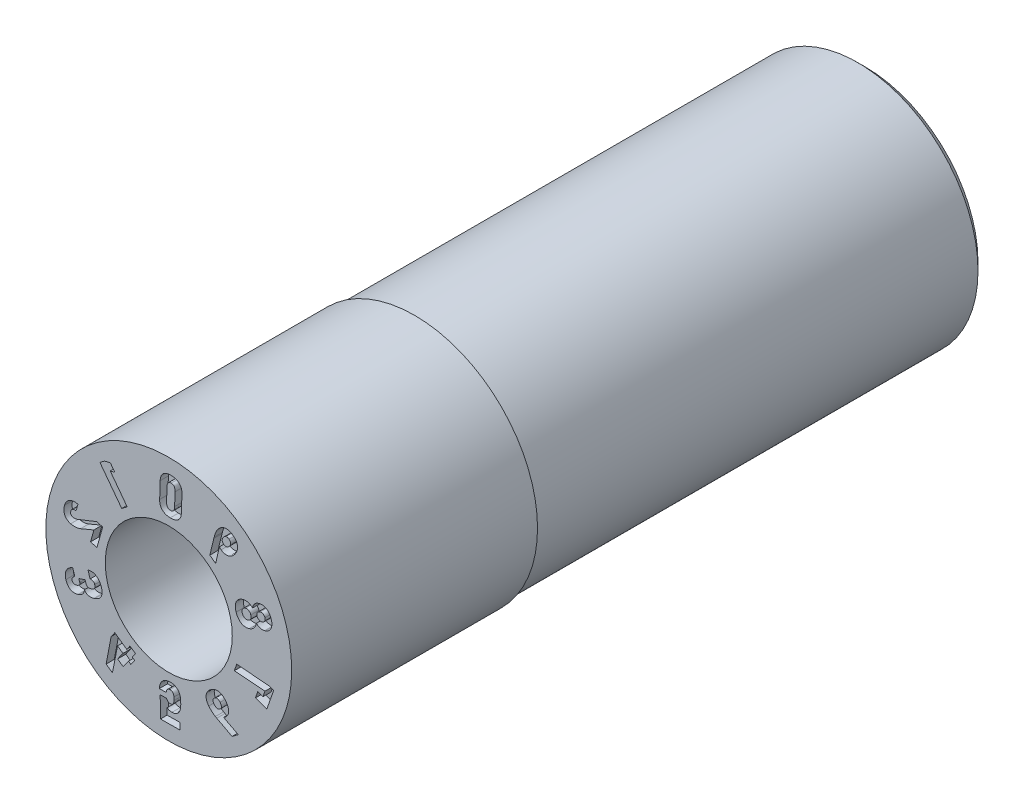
from build123d import *

# Parameters (mm, degrees)
SKETCH4_W          = 11
SKETCH4_H          = 1
CUT_EXTRUDE1_DEPTH = 0.2
CUT_EXTRUDE2_DEPTH = 1.4


with BuildPart() as part:
    # Sketch1 → Revolve1 (revolve)
    with BuildSketch(Plane(origin=(0, 0, 0), x_dir=(0, 0, -1), z_dir=(1, 0, 0)), mode=Mode.PRIVATE) as revolve1_sk:
        Polygon((0, 3), (0, 1.55), (2.8, 1.55), (2.8, 0.8), (14, 0.8), (14, 1.5), (17, 1.5), (17, 2.75), (16.75, 3), align=None)
    revolve(revolve1_sk.sketch.rotate(Axis((0, 0, 3.797909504), (0, 0, -1)), 90), axis=Axis((0, 0, 3.797909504), (0, 0, -1)))

    # Sketch4 → Cut-Revolve1 (revolve, cut)
    with BuildSketch(Plane(origin=(0, 0, 0), x_dir=(0, 0, -1), z_dir=(1, 0, 0)), mode=Mode.PRIVATE) as cut_revolve1_sk:
        with Locations((11.5, 3.435)):
            Rectangle(SKETCH4_W, SKETCH4_H)
    revolve(cut_revolve1_sk.sketch.rotate(Axis((0, 0, 0), (0, 0, -1)), 90), axis=Axis((0, 0, 0), (0, 0, -1)), mode=Mode.SUBTRACT)

    # Sketch2 → Cut-Extrude1 (cut)
    # profile 1 of 10: a face of its own
    with BuildSketch(Plane.XY):
        with BuildLine():
            Line((1.964602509, 0.360281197), (1.978305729, 0.364923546))
            add(Edge.make_bspline(
                [(1.978305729, 0.364923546), (1.999021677, 0.371653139), (2.028594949, 0.386307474), (2.062842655, 0.413973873), (2.085719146, 0.438402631), (2.1052431, 0.465706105), (2.126346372, 0.504769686), (2.134925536, 0.537074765), (2.137948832, 0.55886042)],
                knots=[0, 0, 0, 0, 0.246977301, 0.370172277, 0.497924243, 0.625566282, 0.750117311, 1, 1, 1, 1], degree=3))
            add(Edge.make_bspline(
                [(2.137948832, 0.55886042), (2.151127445, 0.545386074), (2.173444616, 0.527960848), (2.206977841, 0.511088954), (2.233397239, 0.501976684), (2.260490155, 0.496399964), (2.296360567, 0.494101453), (2.322846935, 0.498784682), (2.339563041, 0.504291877)],
                knots=[0, 0, 0, 0, 0.257134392, 0.383027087, 0.511099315, 0.63762545, 0.759670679, 1, 1, 1, 1], degree=3))
            Line((2.339563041, 0.504291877), (2.361401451, 0.511654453))
            add(Edge.make_bspline(
                [(2.361401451, 0.511654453), (2.382108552, 0.518761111), (2.411901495, 0.532182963), (2.445782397, 0.558243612), (2.467183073, 0.580585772), (2.485380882, 0.605414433), (2.499315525, 0.632951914), (2.509553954, 0.662567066), (2.515563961, 0.694213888), (2.517836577, 0.72751529), (2.515072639, 0.774795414), (2.506337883, 0.8101513), (2.498644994, 0.833531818)],
                knots=[0, 0, 0, 0, 0.167140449, 0.246141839, 0.32429089, 0.402157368, 0.479801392, 0.558524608, 0.640148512, 0.72448726, 0.81225289, 1, 1, 1, 1], degree=3))
            add(Edge.make_bspline(
                [(2.498644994, 0.833531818), (2.490694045, 0.856893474), (2.476526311, 0.89048181), (2.450317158, 0.930008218), (2.428613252, 0.955335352), (2.404753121, 0.977008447), (2.378812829, 0.994501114), (2.35109959, 1.008034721), (2.321751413, 1.017201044), (2.291155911, 1.022097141), (2.248450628, 1.022395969), (2.216499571, 1.015695), (2.195720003, 1.008769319)],
                knots=[0, 0, 0, 0, 0.188262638, 0.275658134, 0.360331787, 0.44174499, 0.520455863, 0.597882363, 0.675873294, 0.753814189, 0.833077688, 1, 1, 1, 1], degree=3))
            Line((2.195720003, 1.008769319), (2.173881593, 1.001406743))
            add(Edge.make_bspline(
                [(2.173881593, 1.001406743), (2.156757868, 0.996044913), (2.132876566, 0.983189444), (2.104937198, 0.96001663), (2.086865, 0.938895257), (2.071212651, 0.915643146), (2.055116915, 0.881527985), (2.048020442, 0.853998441), (2.045931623, 0.835131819)],
                knots=[0, 0, 0, 0, 0.242123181, 0.364086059, 0.49024928, 0.617698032, 0.743096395, 1, 1, 1, 1], degree=3))
            add(Edge.make_bspline(
                [(2.045931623, 0.835131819), (2.030312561, 0.851069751), (2.003665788, 0.871822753), (1.963168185, 0.891047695), (1.931146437, 0.901348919), (1.898246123, 0.907382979), (1.854338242, 0.909158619), (1.821886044, 0.903240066), (1.80123526, 0.89645942)],
                knots=[0, 0, 0, 0, 0.252199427, 0.377454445, 0.505057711, 0.631379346, 0.754394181, 1, 1, 1, 1], degree=3))
            Line((1.80123526, 0.89645942), (1.787532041, 0.89181707))
            add(Edge.make_bspline(
                [(1.787532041, 0.89181707), (1.765494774, 0.884372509), (1.734016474, 0.869923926), (1.698002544, 0.842328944), (1.675291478, 0.818623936), (1.656242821, 0.792087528), (1.641445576, 0.762904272), (1.630953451, 0.731280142), (1.624345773, 0.697532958), (1.622210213, 0.661894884), (1.625524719, 0.611304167), (1.634495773, 0.573406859), (1.642966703, 0.548376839)],
                knots=[0, 0, 0, 0, 0.166585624, 0.245063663, 0.323249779, 0.400569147, 0.477894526, 0.556350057, 0.63817055, 0.723193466, 0.810970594, 1, 1, 1, 1], degree=3))
            add(Edge.make_bspline(
                [(1.642966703, 0.548376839), (1.651377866, 0.523313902), (1.666885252, 0.48760909), (1.694469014, 0.445100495), (1.717650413, 0.41801522), (1.74287253, 0.394579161), (1.77054307, 0.375849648), (1.799857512, 0.361260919), (1.830964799, 0.351454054), (1.863371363, 0.346199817), (1.908698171, 0.345591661), (1.942555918, 0.353086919), (1.964602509, 0.360281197)],
                knots=[0, 0, 0, 0, 0.189148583, 0.276863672, 0.361539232, 0.44357587, 0.522394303, 0.59972543, 0.677021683, 0.754789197, 0.833794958, 1, 1, 1, 1], degree=3))
        make_face()
        with BuildLine():
            Line((1.863082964, 0.741611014), (1.871218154, 0.74433124))
            add(Edge.make_bspline(
                [(1.871218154, 0.74433124), (1.880125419, 0.747311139), (1.893869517, 0.750183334), (1.912189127, 0.749679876), (1.925314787, 0.747443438), (1.937900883, 0.74331078), (1.949854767, 0.737448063), (1.961007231, 0.729832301), (1.971385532, 0.720602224), (1.980628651, 0.709606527), (1.992225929, 0.692718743), (1.998212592, 0.678066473), (2.001674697, 0.667959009)],
                knots=[0, 0, 0, 0, 0.166218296, 0.245090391, 0.322722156, 0.400755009, 0.478423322, 0.557266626, 0.638757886, 0.723096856, 0.810567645, 1, 1, 1, 1], degree=3))
            add(Edge.make_bspline(
                [(2.001674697, 0.667959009), (2.004932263, 0.657796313), (2.008911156, 0.642518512), (2.009894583, 0.622044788), (2.008872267, 0.607671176), (2.006390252, 0.593899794), (2.001936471, 0.581009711), (1.995832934, 0.569074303), (1.988026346, 0.558245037), (1.978797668, 0.548543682), (1.964196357, 0.537306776), (1.951459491, 0.53138556), (1.942490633, 0.528476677)],
                knots=[0, 0, 0, 0, 0.188381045, 0.275513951, 0.359781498, 0.441669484, 0.52114919, 0.598996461, 0.676872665, 0.755389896, 0.833935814, 1, 1, 1, 1], degree=3))
            Line((1.942490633, 0.528476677), (1.933813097, 0.525575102))
            add(Edge.make_bspline(
                [(1.933813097, 0.525575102), (1.924123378, 0.522347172), (1.909345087, 0.519161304), (1.889500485, 0.518810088), (1.875350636, 0.520901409), (1.861813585, 0.524720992), (1.849058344, 0.530364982), (1.837099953, 0.537701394), (1.826335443, 0.547112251), (1.81652342, 0.557906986), (1.805273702, 0.574934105), (1.798471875, 0.588952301), (1.795330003, 0.599082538)],
                knots=[0, 0, 0, 0, 0.173701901, 0.255120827, 0.336326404, 0.416101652, 0.493685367, 0.572898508, 0.653753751, 0.736097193, 0.82027794, 1, 1, 1, 1], degree=3))
            add(Edge.make_bspline(
                [(1.795330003, 0.599082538), (1.791985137, 0.60908734), (1.788427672, 0.624412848), (1.787894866, 0.644899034), (1.789073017, 0.659569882), (1.79239661, 0.673572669), (1.797434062, 0.686763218), (1.804522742, 0.698925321), (1.813146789, 0.710186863), (1.823560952, 0.720266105), (1.839688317, 0.731942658), (1.853318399, 0.738624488), (1.863082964, 0.741611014)],
                knots=[0, 0, 0, 0, 0.178658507, 0.263512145, 0.345804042, 0.426861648, 0.50607112, 0.583710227, 0.664091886, 0.745271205, 0.827853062, 1, 1, 1, 1], degree=3))
        make_face(mode=Mode.SUBTRACT)
        with BuildLine():
            Line((2.220254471, 0.841263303), (2.228245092, 0.84387489))
            add(Edge.make_bspline(
                [(2.228245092, 0.84387489), (2.236659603, 0.846585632), (2.249409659, 0.849571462), (2.266425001, 0.849817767), (2.278451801, 0.848444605), (2.289899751, 0.845209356), (2.300708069, 0.84055882), (2.310814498, 0.83447973), (2.319974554, 0.826697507), (2.328328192, 0.817709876), (2.338379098, 0.803547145), (2.343463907, 0.791239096), (2.346534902, 0.782790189)],
                knots=[0, 0, 0, 0, 0.177306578, 0.259345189, 0.339545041, 0.4186855, 0.496490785, 0.574445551, 0.653742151, 0.736205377, 0.819476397, 1, 1, 1, 1], degree=3))
            add(Edge.make_bspline(
                [(2.346534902, 0.782790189), (2.349215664, 0.774218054), (2.352617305, 0.761228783), (2.352832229, 0.743826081), (2.351712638, 0.731535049), (2.348841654, 0.7198688), (2.344617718, 0.708809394), (2.338579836, 0.698611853), (2.330965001, 0.689342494), (2.322144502, 0.680868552), (2.308329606, 0.670745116), (2.296227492, 0.66562681), (2.287911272, 0.662730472)],
                knots=[0, 0, 0, 0, 0.179778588, 0.264113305, 0.345718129, 0.425073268, 0.502737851, 0.580810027, 0.660046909, 0.741092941, 0.823978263, 1, 1, 1, 1], degree=3))
            Line((2.287911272, 0.662730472), (2.279233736, 0.659828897))
            add(Edge.make_bspline(
                [(2.279233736, 0.659828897), (2.270461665, 0.656972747), (2.257045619, 0.653856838), (2.239133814, 0.653278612), (2.22634569, 0.654347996), (2.214294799, 0.657268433), (2.202842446, 0.66160841), (2.192275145, 0.667647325), (2.182522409, 0.675161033), (2.173737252, 0.684086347), (2.163456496, 0.698239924), (2.158072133, 0.71053056), (2.155122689, 0.719027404)],
                knots=[0, 0, 0, 0, 0.179105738, 0.264698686, 0.346614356, 0.427117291, 0.504294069, 0.583324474, 0.662147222, 0.742310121, 0.825294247, 1, 1, 1, 1], degree=3))
            add(Edge.make_bspline(
                [(2.155122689, 0.719027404), (2.152231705, 0.727541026), (2.14932644, 0.740621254), (2.149147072, 0.758073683), (2.15073535, 0.770511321), (2.154166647, 0.782300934), (2.158922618, 0.79355591), (2.165605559, 0.803931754), (2.173652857, 0.813716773), (2.183446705, 0.822295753), (2.198491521, 0.832637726), (2.211213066, 0.838437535), (2.220254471, 0.841263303)],
                knots=[0, 0, 0, 0, 0.173002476, 0.255063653, 0.33456394, 0.413146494, 0.490488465, 0.568625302, 0.649590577, 0.733328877, 0.818008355, 1, 1, 1, 1], degree=3))
        make_face(mode=Mode.SUBTRACT)
    # profile 2 of 10: a face of its own
    with BuildSketch(Plane.XY):
        Polygon((-1.025586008, -1.57403933), (-1.317138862, -1.366897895), (-1.406106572, -1.491966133), (-1.528836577, -2.135889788), (-1.374804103, -2.24517577), (-1.250372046, -1.611578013), (-1.118749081, -1.705127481), (-1.248608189, -1.887849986), (-1.11261327, -1.984486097), (-0.982763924, -1.801777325), (-0.926053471, -1.84208361), (-0.832889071, -1.710945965), (-0.889584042, -1.670665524), (-0.810498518, -1.559385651), (-0.946493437, -1.462749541), align=None)
    # profile 3 of 10: a face of its own
    with BuildSketch(Plane.XY):
        with BuildLine():
            Line((1.099289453, 1.833157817), (1.001811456, 1.431176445))
            Line((1.001811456, 1.431176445), (1.145009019, 1.326148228))
            Line((1.145009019, 1.326148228), (1.234386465, 1.724100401))
            add(Edge.make_bspline(
                [(1.234386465, 1.724100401), (1.234844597, 1.723490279), (1.238974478, 1.718068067), (1.2520167, 1.70281286), (1.266960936, 1.690445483), (1.277522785, 1.682527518)],
                knots=[0.56480822, 0.56480822, 0.56480822, 0.56480822, 0.581366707, 0.712723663, 1, 1, 1, 1], degree=3))
            add(Edge.make_bspline(
                [(1.277522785, 1.682527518), (1.294724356, 1.669943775), (1.32237193, 1.65432062), (1.362120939, 1.642053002), (1.392063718, 1.637779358), (1.422242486, 1.637908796), (1.452224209, 1.642661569), (1.481878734, 1.65159691), (1.510908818, 1.664977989), (1.539012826, 1.682614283), (1.575625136, 1.712184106), (1.599545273, 1.739289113), (1.614042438, 1.759031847)],
                knots=[0, 0, 0, 0, 0.16489712, 0.24313443, 0.320511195, 0.397949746, 0.47569089, 0.554488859, 0.636784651, 0.722171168, 0.81048378, 1, 1, 1, 1], degree=3))
            add(Edge.make_bspline(
                [(1.614042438, 1.759031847), (1.630141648, 1.781256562), (1.650985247, 1.814597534), (1.669358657, 1.861979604), (1.677753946, 1.89608169), (1.681315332, 1.92966678), (1.679395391, 1.962443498), (1.672754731, 1.99428175), (1.660819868, 2.025042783), (1.644268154, 2.05475206), (1.614555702, 2.093561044), (1.586161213, 2.118426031), (1.565536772, 2.133684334)],
                knots=[0, 0, 0, 0, 0.187702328, 0.272978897, 0.354472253, 0.432702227, 0.50827368, 0.583207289, 0.659269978, 0.738161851, 0.820329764, 1, 1, 1, 1], degree=3))
            add(Edge.make_bspline(
                [(1.565536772, 2.133684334), (1.544879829, 2.148623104), (1.512752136, 2.16832126), (1.466758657, 2.184458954), (1.433356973, 2.191505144), (1.400194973, 2.193359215), (1.367560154, 2.19004229), (1.335620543, 2.181432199), (1.304388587, 2.167986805), (1.274210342, 2.149470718), (1.23443835, 2.117211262), (1.208204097, 2.087563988), (1.192374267, 2.065581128)],
                knots=[0, 0, 0, 0, 0.177887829, 0.259816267, 0.338331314, 0.414816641, 0.490131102, 0.565735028, 0.644250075, 0.726092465, 0.811433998, 1, 1, 1, 1], degree=3))
            add(Edge.make_bspline(
                [(1.192374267, 2.065581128), (1.182799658, 2.052781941), (1.17024224, 2.032416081), (1.155415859, 2.003408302), (1.145013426, 1.979422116), (1.13520688, 1.953896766), (1.122043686, 1.916929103), (1.114022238, 1.887895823), (1.108395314, 1.868125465)],
                knots=[0, 0, 0, 0, 0.216886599, 0.332678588, 0.453535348, 0.580868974, 0.713539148, 1, 1, 1, 1], degree=3))
            add(Edge.make_bspline(
                [(1.108395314, 1.868125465), (1.106502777, 1.862317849), (1.103501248, 1.850648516), (1.100297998, 1.839028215), (1.099289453, 1.833157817)],
                knots=[0, 0, 0, 0, 0.506531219, 1, 1, 1, 1], degree=3))
        make_face()
        with BuildLine():
            add(Edge.make_bspline(
                [(1.342198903, 1.829578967), (1.331455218, 1.83736316), (1.317246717, 1.851389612), (1.306510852, 1.874768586), (1.303044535, 1.893097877), (1.303996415, 1.912379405), (1.311103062, 1.940324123), (1.32295224, 1.959729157), (1.331954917, 1.972305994)],
                knots=[0, 0, 0, 0, 0.246294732, 0.358615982, 0.470671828, 0.587630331, 0.712559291, 1, 1, 1, 1], degree=3))
            add(Edge.make_bspline(
                [(1.331954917, 1.972305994), (1.341156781, 1.984993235), (1.356108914, 2.000785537), (1.379690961, 2.015571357), (1.397523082, 2.021371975), (1.41569213, 2.023212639), (1.440946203, 2.019530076), (1.458548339, 2.010494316), (1.469136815, 2.002413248)],
                knots=[0, 0, 0, 0, 0.283785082, 0.405907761, 0.522128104, 0.634954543, 0.748096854, 1, 1, 1, 1], degree=3))
            add(Edge.make_bspline(
                [(1.469136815, 2.002413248), (1.479937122, 1.99454623), (1.494367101, 1.980599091), (1.505375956, 1.957287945), (1.508946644, 1.93919959), (1.508279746, 1.920383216), (1.501695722, 1.89328344), (1.490153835, 1.874605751), (1.481561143, 1.862438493)],
                knots=[0, 0, 0, 0, 0.252475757, 0.3668725, 0.47960218, 0.595680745, 0.718088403, 1, 1, 1, 1], degree=3))
            add(Edge.make_bspline(
                [(1.481561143, 1.862438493), (1.471899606, 1.849511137), (1.457104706, 1.83229025), (1.432561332, 1.817487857), (1.414638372, 1.810723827), (1.396151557, 1.808782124), (1.370619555, 1.812190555), (1.35286976, 1.821529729), (1.342198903, 1.829578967)],
                knots=[0, 0, 0, 0, 0.286977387, 0.411209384, 0.527402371, 0.638802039, 0.751662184, 1, 1, 1, 1], degree=3))
        make_face(mode=Mode.SUBTRACT)
    # profile 4 of 10: a face of its own
    with BuildSketch(Plane.XY):
        with BuildLine():
            Line((0.308539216, 1.980095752), (0.321460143, 2.383350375))
            add(Edge.make_bspline(
                [(0.321460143, 2.383350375), (0.321889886, 2.402195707), (0.321389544, 2.429982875), (0.314999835, 2.465523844), (0.308374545, 2.489968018), (0.299743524, 2.512894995), (0.288684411, 2.534128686), (0.275497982, 2.553775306), (0.259962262, 2.571624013), (0.242429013, 2.587789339), (0.222822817, 2.601990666), (0.201201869, 2.614051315), (0.177747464, 2.624283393), (0.152212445, 2.632303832), (0.114407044, 2.640350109), (0.084726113, 2.64318437), (0.064375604, 2.643907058)],
                knots=[0, 0, 0, 0, 0.135818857, 0.198843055, 0.25932173, 0.31779611, 0.374699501, 0.431160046, 0.487607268, 0.544517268, 0.602364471, 0.661319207, 0.722276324, 0.786130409, 0.853499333, 1, 1, 1, 1], degree=3))
            add(Edge.make_bspline(
                [(0.064375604, 2.643907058), (0.043971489, 2.644392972), (0.014043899, 2.643982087), (-0.024170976, 2.637815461), (-0.050296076, 2.631856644), (-0.074368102, 2.623041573), (-0.096777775, 2.612534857), (-0.117241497, 2.599764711), (-0.135667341, 2.584778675), (-0.152165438, 2.567938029), (-0.166738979, 2.549326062), (-0.178920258, 2.528738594), (-0.189334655, 2.506578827), (-0.197375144, 2.482513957), (-0.206087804, 2.44731718), (-0.208379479, 2.419475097), (-0.209216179, 2.400545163)],
                knots=[0, 0, 0, 0, 0.146922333, 0.214044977, 0.277959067, 0.339182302, 0.397900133, 0.455579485, 0.512066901, 0.56819598, 0.624703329, 0.681512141, 0.739766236, 0.800351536, 0.863565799, 1, 1, 1, 1], degree=3))
            Line((-0.209216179, 2.400545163), (-0.222137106, 1.99729054))
            add(Edge.make_bspline(
                [(-0.222137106, 1.99729054), (-0.222565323, 1.978445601), (-0.222069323, 1.950657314), (-0.21567296, 1.915118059), (-0.209079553, 1.890722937), (-0.20040336, 1.867833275), (-0.189154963, 1.846726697), (-0.175937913, 1.8270282), (-0.160526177, 1.809005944), (-0.142934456, 1.792912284), (-0.123479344, 1.77859656), (-0.101830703, 1.766552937), (-0.078289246, 1.756387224), (-0.052766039, 1.74835027), (-0.015030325, 1.740255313), (0.014599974, 1.737472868), (0.034947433, 1.736733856)],
                knots=[0, 0, 0, 0, 0.135852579, 0.198892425, 0.259386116, 0.317476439, 0.374610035, 0.431084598, 0.487863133, 0.544787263, 0.60228845, 0.661257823, 0.722634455, 0.786504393, 0.853462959, 1, 1, 1, 1], degree=3))
            add(Edge.make_bspline(
                [(0.034947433, 1.736733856), (0.055365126, 1.736194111), (0.085254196, 1.736757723), (0.123560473, 1.742698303), (0.149567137, 1.749264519), (0.17375853, 1.757897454), (0.196125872, 1.768668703), (0.216596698, 1.781604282), (0.235087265, 1.79677713), (0.251457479, 1.813884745), (0.26588879, 1.832688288), (0.278345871, 1.853103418), (0.288635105, 1.875293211), (0.296820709, 1.899176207), (0.304966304, 1.934070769), (0.30800387, 1.961405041), (0.308539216, 1.980095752)],
                knots=[0, 0, 0, 0, 0.147137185, 0.214357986, 0.278606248, 0.339919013, 0.398925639, 0.456934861, 0.513791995, 0.570649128, 0.626987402, 0.684089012, 0.742428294, 0.802686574, 0.865482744, 1, 1, 1, 1], degree=3))
        make_face()
        with BuildLine():
            Line((-0.05362895, 2.034658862), (-0.043337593, 2.352414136))
            add(Edge.make_bspline(
                [(-0.043337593, 2.352414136), (-0.042489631, 2.371460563), (-0.0400752, 2.398957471), (-0.028306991, 2.431506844), (-0.018945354, 2.447909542), (-0.009890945, 2.45863898), (-0.002508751, 2.465636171), (0.005948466, 2.471093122), (0.014881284, 2.476089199), (0.024867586, 2.479355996), (0.03959694, 2.482499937), (0.051196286, 2.483339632), (0.059144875, 2.482861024)],
                knots=[0, 0, 0, 0, 0.304248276, 0.43195801, 0.547131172, 0.601686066, 0.654466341, 0.707867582, 0.761045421, 0.8164911, 0.873820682, 1, 1, 1, 1], degree=3))
            add(Edge.make_bspline(
                [(0.059144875, 2.482861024), (0.067116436, 2.482868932), (0.078556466, 2.481190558), (0.09312235, 2.477314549), (0.102694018, 2.472979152), (0.111707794, 2.468108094), (0.119404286, 2.461593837), (0.12654968, 2.454409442), (0.134822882, 2.443015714), (0.143099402, 2.426089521), (0.152523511, 2.392805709), (0.153190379, 2.365264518), (0.152959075, 2.346162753)],
                knots=[0, 0, 0, 0, 0.126047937, 0.183166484, 0.238632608, 0.292582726, 0.345234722, 0.398051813, 0.453219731, 0.568052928, 0.695198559, 1, 1, 1, 1], degree=3))
            Line((0.152959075, 2.346162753), (0.142667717, 2.028407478))
            add(Edge.make_bspline(
                [(0.142667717, 2.028407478), (0.141968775, 2.00930338), (0.139152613, 1.981920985), (0.127906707, 1.949125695), (0.118417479, 1.932756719), (0.109407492, 1.921913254), (0.101837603, 1.915152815), (0.09357109, 1.909368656), (0.084377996, 1.904882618), (0.074512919, 1.901203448), (0.059699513, 1.898205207), (0.048141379, 1.897265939), (0.040178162, 1.897779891)],
                knots=[0, 0, 0, 0, 0.303868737, 0.432040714, 0.547070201, 0.601557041, 0.654951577, 0.707518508, 0.760989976, 0.816720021, 0.873978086, 1, 1, 1, 1], degree=3))
            add(Edge.make_bspline(
                [(0.040178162, 1.897779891), (0.032307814, 1.89831691), (0.020650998, 1.899135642), (0.006304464, 1.903655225), (-0.003461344, 1.907485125), (-0.012109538, 1.912904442), (-0.020206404, 1.918936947), (-0.027088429, 1.926371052), (-0.0354256, 1.937702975), (-0.043482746, 1.954736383), (-0.053410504, 1.987919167), (-0.053730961, 2.015602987), (-0.05362895, 2.034658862)],
                knots=[0, 0, 0, 0, 0.125945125, 0.183291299, 0.238413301, 0.291967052, 0.344823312, 0.398300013, 0.452118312, 0.567781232, 0.695222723, 1, 1, 1, 1], degree=3))
        make_face(mode=Mode.SUBTRACT)
    # profile 5 of 10: a face of its own
    with BuildSketch(Plane.XY):
        Polygon((-1.147767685, 1.343521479), (-1.014558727, 1.443738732), (-1.428816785, 1.994155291), (-1.318332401, 2.026392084), (-1.424847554, 2.167807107), (-1.566207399, 2.13616004), (-1.679995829, 2.050496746), align=None)
    # profile 6 of 10: a face of its own
    with BuildSketch(Plane.XY):
        with BuildLine():
            Line((-1.757329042, 0.759559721), (-2.225232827, 0.574508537))
            add(Edge.make_bspline(
                [(-2.225232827, 0.574508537), (-2.244968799, 0.566656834), (-2.270649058, 0.559351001), (-2.301517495, 0.557578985), (-2.319663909, 0.557302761), (-2.332711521, 0.559893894), (-2.340978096, 0.561864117)],
                knots=[0, 0, 0, 0, 0.540718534, 0.665819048, 0.783786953, 1, 1, 1, 1], degree=3))
            Line((-2.340978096, 0.561864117), (-2.342247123, 0.56221456))
            add(Edge.make_bspline(
                [(-2.342247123, 0.56221456), (-2.352616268, 0.565179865), (-2.367291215, 0.571873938), (-2.382187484, 0.586536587), (-2.389897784, 0.599556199), (-2.39485481, 0.614431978), (-2.397021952, 0.63790424), (-2.393754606, 0.656139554), (-2.390348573, 0.66844971)],
                knots=[0, 0, 0, 0, 0.245532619, 0.356636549, 0.469170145, 0.58559901, 0.709489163, 1, 1, 1, 1], degree=3))
            add(Edge.make_bspline(
                [(-2.390348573, 0.66844971), (-2.38671198, 0.680587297), (-2.379018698, 0.698313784), (-2.361478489, 0.716154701), (-2.346141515, 0.726505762), (-2.328275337, 0.733404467), (-2.300516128, 0.739048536), (-2.278360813, 0.736941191), (-2.263416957, 0.734853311)],
                knots=[0, 0, 0, 0, 0.241005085, 0.354164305, 0.468189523, 0.587647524, 0.713237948, 1, 1, 1, 1], degree=3))
            Line((-2.263416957, 0.734853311), (-2.216401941, 0.899785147))
            add(Edge.make_bspline(
                [(-2.216401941, 0.899785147), (-2.242594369, 0.905432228), (-2.280719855, 0.909981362), (-2.330576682, 0.907330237), (-2.365117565, 0.900962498), (-2.397495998, 0.890598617), (-2.42730178, 0.876052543), (-2.454544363, 0.857759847), (-2.479125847, 0.835691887), (-2.500518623, 0.809781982), (-2.525568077, 0.77005431), (-2.538603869, 0.736507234), (-2.545248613, 0.713158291)],
                knots=[0, 0, 0, 0, 0.185278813, 0.271234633, 0.354095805, 0.434333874, 0.512207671, 0.589109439, 0.666944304, 0.74622659, 0.827241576, 1, 1, 1, 1], degree=3))
            add(Edge.make_bspline(
                [(-2.545248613, 0.713158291), (-2.552180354, 0.688306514), (-2.559611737, 0.651327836), (-2.561137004, 0.602731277), (-2.558273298, 0.5695422), (-2.55127408, 0.538589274), (-2.540167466, 0.510027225), (-2.524960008, 0.48413899), (-2.506033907, 0.460760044), (-2.483191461, 0.440322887), (-2.446888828, 0.416189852), (-2.415458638, 0.404083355), (-2.393506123, 0.397965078)],
                knots=[0, 0, 0, 0, 0.19504193, 0.283139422, 0.366460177, 0.445986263, 0.522022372, 0.596986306, 0.671868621, 0.748307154, 0.827593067, 1, 1, 1, 1], degree=3))
            add(Edge.make_bspline(
                [(-2.393506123, 0.397965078), (-2.373407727, 0.392321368), (-2.343490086, 0.386656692), (-2.302758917, 0.384464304), (-2.27167898, 0.385384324), (-2.240653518, 0.388528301), (-2.200136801, 0.395985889), (-2.170859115, 0.405604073), (-2.151977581, 0.413317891)],
                knots=[0, 0, 0, 0, 0.245803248, 0.370307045, 0.497523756, 0.625182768, 0.750821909, 1, 1, 1, 1], degree=3))
            Line((-2.151977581, 0.413317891), (-1.827255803, 0.54908027))
            Line((-1.827255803, 0.54908027), (-1.909254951, 0.256997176))
            Line((-1.909254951, 0.256997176), (-1.75409864, 0.213403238))
            Line((-1.75409864, 0.213403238), (-1.612076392, 0.718829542))
            Line((-1.612076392, 0.718829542), (-1.757329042, 0.759559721))
        make_face()
    # profile 7 of 10: a face of its own
    with BuildSketch(Plane.XY):
        with BuildLine():
            Line((-1.972691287, -0.3676873), (-1.919082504, -0.532316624))
            add(Edge.make_bspline(
                [(-1.919082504, -0.532316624), (-1.910491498, -0.530562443), (-1.897734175, -0.529628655), (-1.881058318, -0.530456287), (-1.869610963, -0.532975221), (-1.858776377, -0.536475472), (-1.84885294, -0.541398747), (-1.839774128, -0.547447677), (-1.831490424, -0.554558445), (-1.82420304, -0.562986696), (-1.815131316, -0.575762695), (-1.810565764, -0.586955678), (-1.808010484, -0.594655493)],
                knots=[0, 0, 0, 0, 0.186215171, 0.271745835, 0.35462275, 0.435117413, 0.513799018, 0.589739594, 0.667057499, 0.745560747, 0.826555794, 1, 1, 1, 1], degree=3))
            add(Edge.make_bspline(
                [(-1.808010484, -0.594655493), (-1.803902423, -0.608246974), (-1.799404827, -0.629011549), (-1.803196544, -0.655846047), (-1.809927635, -0.673450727), (-1.820501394, -0.689026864), (-1.840554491, -0.707517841), (-1.859960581, -0.716406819), (-1.873730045, -0.720891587)],
                knots=[0, 0, 0, 0, 0.265552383, 0.384160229, 0.498068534, 0.612278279, 0.730214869, 1, 1, 1, 1], degree=3))
            Line((-1.873730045, -0.720891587), (-1.893647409, -0.727339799))
            add(Edge.make_bspline(
                [(-1.893647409, -0.727339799), (-1.907958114, -0.732140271), (-1.929270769, -0.736764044), (-1.956896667, -0.736306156), (-1.974550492, -0.732283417), (-1.989923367, -0.724862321), (-2.007632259, -0.71000507), (-2.015497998, -0.693924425), (-2.019277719, -0.682844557)],
                knots=[0, 0, 0, 0, 0.300174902, 0.428715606, 0.546214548, 0.657115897, 0.764966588, 1, 1, 1, 1], degree=3))
            Line((-2.019277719, -0.682844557), (-2.042614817, -0.611100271))
            Line((-2.042614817, -0.611100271), (-2.196332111, -0.661092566))
            Line((-2.196332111, -0.661092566), (-2.172995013, -0.732836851))
            add(Edge.make_bspline(
                [(-2.172995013, -0.732836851), (-2.16993943, -0.741999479), (-2.168303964, -0.756509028), (-2.173076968, -0.775121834), (-2.18064556, -0.787544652), (-2.19082265, -0.7992224), (-2.210117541, -0.813192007), (-2.22717198, -0.820884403), (-2.239675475, -0.824650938)],
                knots=[0, 0, 0, 0, 0.226274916, 0.33317573, 0.444770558, 0.564289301, 0.69438064, 1, 1, 1, 1], degree=3))
            Line((-2.239675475, -0.824650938), (-2.254081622, -0.829362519))
            add(Edge.make_bspline(
                [(-2.254081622, -0.829362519), (-2.265698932, -0.83305672), (-2.28314064, -0.837222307), (-2.305788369, -0.835444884), (-2.320412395, -0.83133391), (-2.33328727, -0.824125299), (-2.348116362, -0.810176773), (-2.355173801, -0.796047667), (-2.358463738, -0.786069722)],
                knots=[0, 0, 0, 0, 0.287213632, 0.411058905, 0.528163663, 0.640053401, 0.753005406, 1, 1, 1, 1], degree=3))
            add(Edge.make_bspline(
                [(-2.358463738, -0.786069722), (-2.360930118, -0.77915462), (-2.362551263, -0.768367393), (-2.36218706, -0.753847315), (-2.36022339, -0.743076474), (-2.356816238, -0.732394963), (-2.351701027, -0.722139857), (-2.345568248, -0.712038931), (-2.337781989, -0.702416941), (-2.32848576, -0.693320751), (-2.31408895, -0.681122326), (-2.301413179, -0.67383103), (-2.292768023, -0.66898518)],
                knots=[0, 0, 0, 0, 0.149485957, 0.221379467, 0.296504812, 0.372836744, 0.450100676, 0.530551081, 0.61435772, 0.702676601, 0.79653766, 1, 1, 1, 1], degree=3))
            Line((-2.292768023, -0.66898518), (-2.346188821, -0.504895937))
            add(Edge.make_bspline(
                [(-2.346188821, -0.504895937), (-2.369742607, -0.515237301), (-2.403465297, -0.532919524), (-2.442128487, -0.56398004), (-2.466638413, -0.589149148), (-2.486917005, -0.616573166), (-2.503503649, -0.645427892), (-2.515230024, -0.676153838), (-2.52322001, -0.708035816), (-2.526657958, -0.741040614), (-2.525333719, -0.786372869), (-2.518581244, -0.820193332), (-2.511160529, -0.842125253)],
                knots=[0, 0, 0, 0, 0.185632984, 0.272058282, 0.356308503, 0.437960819, 0.517155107, 0.59527073, 0.674068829, 0.753304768, 0.833465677, 1, 1, 1, 1], degree=3))
            add(Edge.make_bspline(
                [(-2.511160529, -0.842125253), (-2.505219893, -0.859802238), (-2.495523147, -0.885364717), (-2.478410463, -0.916435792), (-2.465008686, -0.937116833), (-2.449842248, -0.955403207), (-2.433785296, -0.971755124), (-2.416218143, -0.985771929), (-2.397560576, -0.997580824), (-2.377766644, -1.007234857), (-2.356958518, -1.014216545), (-2.335316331, -1.019087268), (-2.31278672, -1.021029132), (-2.289443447, -1.021016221), (-2.256280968, -1.017333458), (-2.231387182, -1.011111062), (-2.214750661, -1.005682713)],
                knots=[0, 0, 0, 0, 0.145426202, 0.211953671, 0.275969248, 0.337024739, 0.396648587, 0.454146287, 0.51161907, 0.568302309, 0.625198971, 0.682178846, 0.7406344, 0.800912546, 0.863711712, 1, 1, 1, 1], degree=3))
            Line((-2.214750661, -1.005682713), (-2.189035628, -0.997277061))
            add(Edge.make_bspline(
                [(-2.189035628, -0.997277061), (-2.170571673, -0.991105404), (-2.144072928, -0.979121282), (-2.11442198, -0.955286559), (-2.095868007, -0.934784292), (-2.080688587, -0.911603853), (-2.064995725, -0.87688187), (-2.059788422, -0.848205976), (-2.058658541, -0.82873538)],
                knots=[0, 0, 0, 0, 0.257452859, 0.378339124, 0.499528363, 0.62073586, 0.742393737, 1, 1, 1, 1], degree=3))
            add(Edge.make_bspline(
                [(-2.058658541, -0.82873538), (-2.053240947, -0.837877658), (-2.044092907, -0.850747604), (-2.029736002, -0.865805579), (-2.018212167, -0.875615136), (-2.006041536, -0.88447066), (-1.992767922, -0.891615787), (-1.978816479, -0.897875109), (-1.964022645, -0.90291942), (-1.948481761, -0.906362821), (-1.93244865, -0.908766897), (-1.915845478, -0.90963554), (-1.898766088, -0.9095336), (-1.881208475, -0.907600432), (-1.85657033, -0.903646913), (-1.838070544, -0.898596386), (-1.825680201, -0.894600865)],
                knots=[0, 0, 0, 0, 0.120906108, 0.178849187, 0.236286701, 0.292915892, 0.349744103, 0.40743903, 0.466789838, 0.527208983, 0.588324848, 0.65104005, 0.716197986, 0.782430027, 0.851784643, 1, 1, 1, 1], degree=3))
            Line((-1.825680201, -0.894600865), (-1.799965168, -0.886195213))
            add(Edge.make_bspline(
                [(-1.799965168, -0.886195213), (-1.777166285, -0.878451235), (-1.74421232, -0.864990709), (-1.706650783, -0.838431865), (-1.682935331, -0.816704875), (-1.663404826, -0.792207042), (-1.647950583, -0.765364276), (-1.637128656, -0.736042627), (-1.630375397, -0.704620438), (-1.62799531, -0.671203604), (-1.630548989, -0.622711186), (-1.639659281, -0.58619927), (-1.647483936, -0.561790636)],
                knots=[0, 0, 0, 0, 0.177931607, 0.25925371, 0.33771272, 0.414055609, 0.489084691, 0.564850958, 0.643296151, 0.725035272, 0.810871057, 1, 1, 1, 1], degree=3))
            add(Edge.make_bspline(
                [(-1.647483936, -0.561790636), (-1.655427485, -0.53749064), (-1.670248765, -0.502675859), (-1.696845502, -0.461012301), (-1.719314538, -0.433930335), (-1.744208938, -0.41044742), (-1.771392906, -0.390816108), (-1.801009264, -0.375628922), (-1.832527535, -0.36433877), (-1.865857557, -0.357753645), (-1.913207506, -0.355176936), (-1.949063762, -0.361303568), (-1.972691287, -0.3676873)],
                knots=[0, 0, 0, 0, 0.18123893, 0.26656409, 0.349497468, 0.429986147, 0.508510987, 0.586299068, 0.665102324, 0.745038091, 0.82622217, 1, 1, 1, 1], degree=3))
        make_face()
    # profile 8 of 10: a face of its own
    with BuildSketch(Plane.XY):
        with BuildLine():
            Line((-0.230006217, -2.003626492), (-0.062693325, -2.002205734))
            add(Edge.make_bspline(
                [(-0.062693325, -2.002205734), (-0.061243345, -1.986932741), (-0.057534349, -1.965517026), (-0.04552866, -1.940418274), (-0.034415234, -1.925094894), (-0.021012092, -1.912723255), (0.000303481, -1.90063307), (0.018723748, -1.897200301), (0.031189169, -1.897233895)],
                knots=[0, 0, 0, 0, 0.286182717, 0.411741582, 0.532403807, 0.648409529, 0.759974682, 1, 1, 1, 1], degree=3))
            add(Edge.make_bspline(
                [(0.031189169, -1.897233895), (0.044418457, -1.897016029), (0.064127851, -1.899791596), (0.086637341, -1.912183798), (0.100467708, -1.92477255), (0.111050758, -1.940963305), (0.122322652, -1.967648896), (0.124136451, -1.990532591), (0.124688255, -2.006129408)],
                knots=[0, 0, 0, 0, 0.245066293, 0.356151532, 0.469290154, 0.58611633, 0.709913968, 1, 1, 1, 1], degree=3))
            Line((0.124688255, -2.006129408), (0.125560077, -2.080463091))
            add(Edge.make_bspline(
                [(0.125560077, -2.080463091), (0.125816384, -2.09610581), (0.123989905, -2.118597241), (0.115030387, -2.145740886), (0.105719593, -2.161856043), (0.093813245, -2.174743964), (0.07403046, -2.187270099), (0.056396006, -2.190773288), (0.044510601, -2.19082419)],
                knots=[0, 0, 0, 0, 0.303731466, 0.432421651, 0.55107677, 0.661791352, 0.769201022, 1, 1, 1, 1], degree=3))
            add(Edge.make_bspline(
                [(0.044510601, -2.19082419), (0.033247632, -2.191080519), (0.016680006, -2.1891108), (-0.00374815, -2.181538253), (-0.017208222, -2.173550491), (-0.029231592, -2.163664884), (-0.042581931, -2.147208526), (-0.049743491, -2.132797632), (-0.052791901, -2.122394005)],
                knots=[0, 0, 0, 0, 0.263351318, 0.385351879, 0.506993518, 0.627815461, 0.747380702, 1, 1, 1, 1], degree=3))
            Line((-0.052791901, -2.122394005), (-0.209056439, -2.124193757))
            Line((-0.209056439, -2.124193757), (-0.202907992, -2.634396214))
            Line((-0.202907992, -2.634396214), (0.273838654, -2.628748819))
            Line((0.273838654, -2.628748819), (0.271886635, -2.467604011))
            Line((0.271886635, -2.467604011), (-0.037564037, -2.471288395))
            Line((-0.037564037, -2.471288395), (-0.039380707, -2.314481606))
            add(Edge.make_bspline(
                [(-0.039380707, -2.314481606), (-0.032629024, -2.320764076), (-0.020846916, -2.329198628), (-0.002771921, -2.337585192), (0.027963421, -2.348738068), (0.055606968, -2.352780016), (0.077602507, -2.352625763)],
                knots=[0, 0, 0, 0, 0.220053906, 0.342991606, 0.474744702, 1, 1, 1, 1], degree=3))
            add(Edge.make_bspline(
                [(0.077602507, -2.352625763), (0.099189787, -2.352621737), (0.130776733, -2.348389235), (0.169943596, -2.334699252), (0.195837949, -2.320346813), (0.218806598, -2.30208388), (0.238772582, -2.28013202), (0.255884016, -2.254701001), (0.269757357, -2.225648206), (0.280447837, -2.193255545), (0.290796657, -2.144146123), (0.293087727, -2.105233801), (0.2926753, -2.07850572)],
                knots=[0, 0, 0, 0, 0.163782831, 0.239793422, 0.313915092, 0.387533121, 0.461673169, 0.538417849, 0.619508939, 0.705404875, 0.796900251, 1, 1, 1, 1], degree=3))
            Line((0.2926753, -2.07850572), (0.291803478, -2.004172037))
            add(Edge.make_bspline(
                [(0.291803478, -2.004172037), (0.291620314, -1.977416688), (0.287715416, -1.938422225), (0.274159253, -1.889594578), (0.260278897, -1.857376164), (0.242689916, -1.828612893), (0.22164318, -1.803356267), (0.196974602, -1.782029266), (0.168947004, -1.764490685), (0.137707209, -1.750713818), (0.090396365, -1.73772362), (0.052659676, -1.734311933), (0.026847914, -1.734897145)],
                knots=[0, 0, 0, 0, 0.186984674, 0.272083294, 0.353195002, 0.431301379, 0.506887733, 0.582003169, 0.658172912, 0.737111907, 0.819706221, 1, 1, 1, 1], degree=3))
            add(Edge.make_bspline(
                [(0.026847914, -1.734897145), (0.004042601, -1.735109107), (-0.029750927, -1.739160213), (-0.072247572, -1.753000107), (-0.101623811, -1.767188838), (-0.128676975, -1.785077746), (-0.153101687, -1.806620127), (-0.174232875, -1.832031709), (-0.192595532, -1.86058663), (-0.207745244, -1.892264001), (-0.223330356, -1.939664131), (-0.228660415, -1.977653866), (-0.230006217, -2.003626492)],
                knots=[0, 0, 0, 0, 0.165240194, 0.244417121, 0.322805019, 0.400845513, 0.478671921, 0.557835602, 0.63947289, 0.724039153, 0.811487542, 1, 1, 1, 1], degree=3))
        make_face()
    # profile 9 of 10: a face of its own
    with BuildSketch(Plane.XY):
        with BuildLine():
            Line((1.171885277, -1.930233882), (1.54422066, -2.128171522))
            Line((1.54422066, -2.128171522), (1.695657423, -2.015069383))
            Line((1.695657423, -2.015069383), (1.338342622, -1.829451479))
            add(Edge.make_bspline(
                [(1.338342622, -1.829451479), (1.348107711, -1.824744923), (1.357347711, -1.818962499), (1.366059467, -1.812533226)],
                knots=[0.758294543, 0.758294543, 0.758294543, 0.758294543, 1, 1, 1, 1], degree=3))
            add(Edge.make_bspline(
                [(1.366059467, -1.812533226), (1.384367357, -1.798951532), (1.409151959, -1.776236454), (1.434487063, -1.740775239), (1.448368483, -1.713421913), (1.457760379, -1.684749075), (1.462104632, -1.654886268), (1.462053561, -1.624058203), (1.457302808, -1.592426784), (1.447994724, -1.560156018), (1.42849412, -1.515342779), (1.408576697, -1.483186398), (1.39290969, -1.46253909)],
                knots=[0, 0, 0, 0, 0.171699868, 0.250620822, 0.326851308, 0.401709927, 0.47666884, 0.552996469, 0.632938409, 0.716616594, 0.805048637, 1, 1, 1, 1], degree=3))
            add(Edge.make_bspline(
                [(1.39290969, -1.46253909), (1.376795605, -1.440585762), (1.350602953, -1.411911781), (1.311423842, -1.380323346), (1.281375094, -1.362598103), (1.250466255, -1.349517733), (1.218737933, -1.341823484), (1.186519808, -1.338805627), (1.153789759, -1.341138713), (1.120774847, -1.348623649), (1.075084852, -1.365324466), (1.043394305, -1.385720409), (1.022713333, -1.40063414)],
                knots=[0, 0, 0, 0, 0.186909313, 0.272040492, 0.353373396, 0.431715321, 0.50745322, 0.582296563, 0.658656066, 0.737404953, 0.81992048, 1, 1, 1, 1], degree=3))
            add(Edge.make_bspline(
                [(1.022713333, -1.40063414), (1.002462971, -1.41592999), (0.974311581, -1.440629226), (0.945480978, -1.479445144), (0.92891576, -1.508761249), (0.917203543, -1.539327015), (0.910619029, -1.570879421), (0.909119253, -1.603240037), (0.912415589, -1.636222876), (0.920850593, -1.669690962), (0.939097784, -1.716100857), (0.959726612, -1.748740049), (0.975382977, -1.769847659)],
                knots=[0, 0, 0, 0, 0.180374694, 0.262964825, 0.341848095, 0.41845766, 0.49412534, 0.569404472, 0.647310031, 0.728323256, 0.813375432, 1, 1, 1, 1], degree=3))
            add(Edge.make_bspline(
                [(0.975382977, -1.769847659), (0.985510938, -1.783781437), (1.002136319, -1.802804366), (1.026173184, -1.827177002), (1.067375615, -1.86414359), (1.10534554, -1.891561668), (1.137635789, -1.910969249)],
                knots=[0, 0, 0, 0, 0.230262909, 0.351032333, 0.476028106, 1, 1, 1, 1], degree=3))
            add(Edge.make_bspline(
                [(1.137635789, -1.910969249), (1.14326305, -1.914536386), (1.154832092, -1.920692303), (1.166072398, -1.927432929), (1.171885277, -1.930233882)],
                knots=[0, 0, 0, 0, 0.508116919, 1, 1, 1, 1], degree=3))
        make_face()
        with BuildLine():
            add(Edge.make_bspline(
                [(1.118980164, -1.529511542), (1.129509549, -1.521291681), (1.146856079, -1.511954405), (1.171794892, -1.507332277), (1.18961307, -1.508535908), (1.206985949, -1.513747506), (1.229856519, -1.527190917), (1.244238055, -1.5421214), (1.252607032, -1.553585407)],
                knots=[0, 0, 0, 0, 0.259580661, 0.374841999, 0.488467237, 0.603269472, 0.72409132, 1, 1, 1, 1], degree=3))
            add(Edge.make_bspline(
                [(1.252607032, -1.553585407), (1.263040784, -1.566985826), (1.274768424, -1.58736096), (1.283633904, -1.615994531), (1.284934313, -1.635756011), (1.282207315, -1.654585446), (1.271538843, -1.678325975), (1.257847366, -1.692947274), (1.246949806, -1.700779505)],
                knots=[0, 0, 0, 0, 0.293578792, 0.419449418, 0.536382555, 0.64740535, 0.758677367, 1, 1, 1, 1], degree=3))
            add(Edge.make_bspline(
                [(1.246949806, -1.700779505), (1.236247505, -1.708317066), (1.21873406, -1.718364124), (1.192901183, -1.720502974), (1.17399001, -1.717920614), (1.155475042, -1.710505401), (1.130122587, -1.694587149), (1.114410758, -1.676946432), (1.104693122, -1.664026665)],
                knots=[0, 0, 0, 0, 0.239636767, 0.34976614, 0.462439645, 0.581193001, 0.706780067, 1, 1, 1, 1], degree=3))
            add(Edge.make_bspline(
                [(1.104693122, -1.664026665), (1.095848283, -1.652220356), (1.085290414, -1.634391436), (1.079312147, -1.608660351), (1.079303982, -1.590703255), (1.083317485, -1.573466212), (1.094460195, -1.551019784), (1.108459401, -1.537359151), (1.118980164, -1.529511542)],
                knots=[0, 0, 0, 0, 0.277360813, 0.398057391, 0.513444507, 0.626018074, 0.741743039, 1, 1, 1, 1], degree=3))
        make_face(mode=Mode.SUBTRACT)
    # profile 10 of 10: a face of its own
    with BuildSketch(Plane.XY):
        Polygon((2.455728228, -0.610667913), (1.659084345, -0.542898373), (1.599484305, -0.713544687), (2.347101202, -0.770769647), (2.296910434, -0.914458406), (2.171023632, -0.87055645), (2.115967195, -1.028060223), (2.393631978, -1.124859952), (2.560359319, -0.647064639), align=None)
    extrude(amount=-CUT_EXTRUDE1_DEPTH, mode=Mode.SUBTRACT)

    # Sketch3 → Cut-Extrude2 (cut)
    with BuildSketch(Plane.XY.offset(-2.8)):
        Polygon((0.461880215, 0.8), (-0.461880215, 0.8), (-0.923760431, 0), (-0.461880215, -0.8), (0.461880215, -0.8), (0.923760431, 0), align=None)
    extrude(amount=-CUT_EXTRUDE2_DEPTH, mode=Mode.SUBTRACT)


solid = part.part
